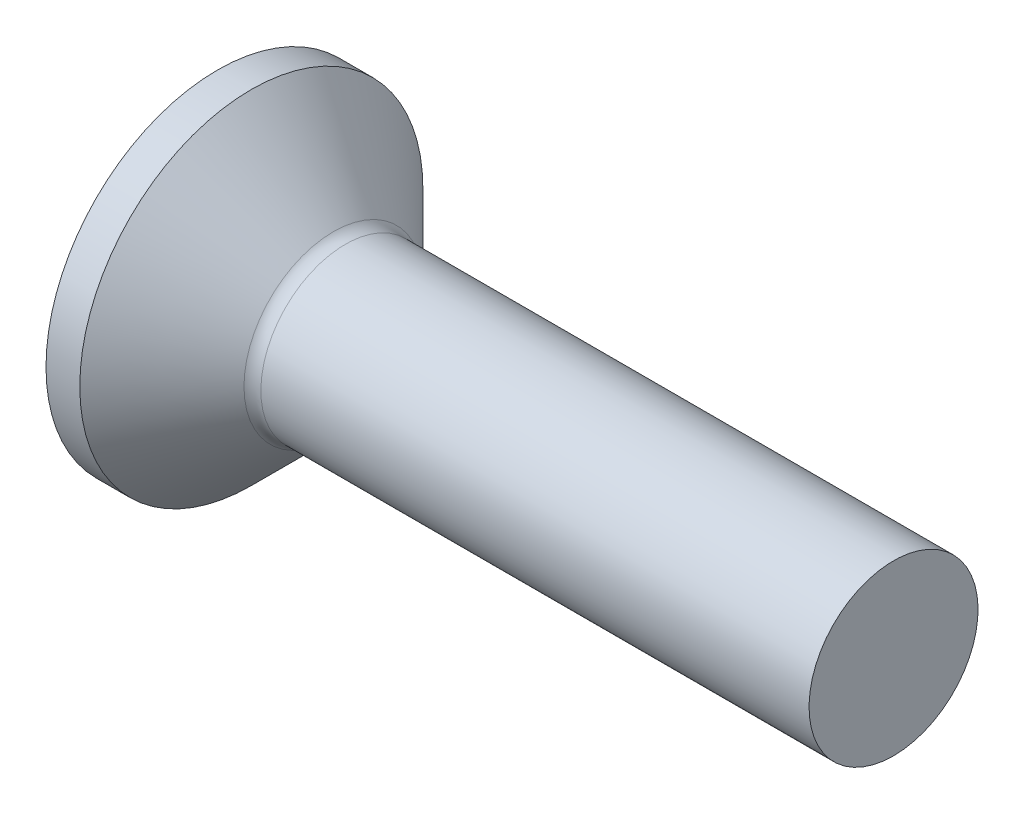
from build123d import *

# Parameters (mm, degrees)
FILLET1_R = 0.1


with BuildPart() as part:
    # Sketch1 → Base-Revolve (revolve)
    with BuildSketch(Plane(origin=(-0.4925, -1.5075, 0), x_dir=(0, 1, 0), z_dir=(0, 0, 1)), mode=Mode.PRIVATE) as base_revolve_sk:
        Polygon((1.5075, -0.4925), (2.5225, -0.4925), (2.5225, -0.6925), (2.0075, -1.2075), (2.0075, -4.4925), (1.5075, -4.4925), align=None)
    revolve(base_revolve_sk.sketch.rotate(Axis((-2.5225, 0, 0), (1, 0, 0)), 180), axis=Axis((-2.5225, 0, 0), (1, 0, 0)))

    # Fillet1
    fillet1_edges = [part.edges().sort_by_distance(p)[0] for p in [
        (0.715, 0.5, 0),
    ]]
    fillet(fillet1_edges, radius=FILLET1_R)


solid = part.part
